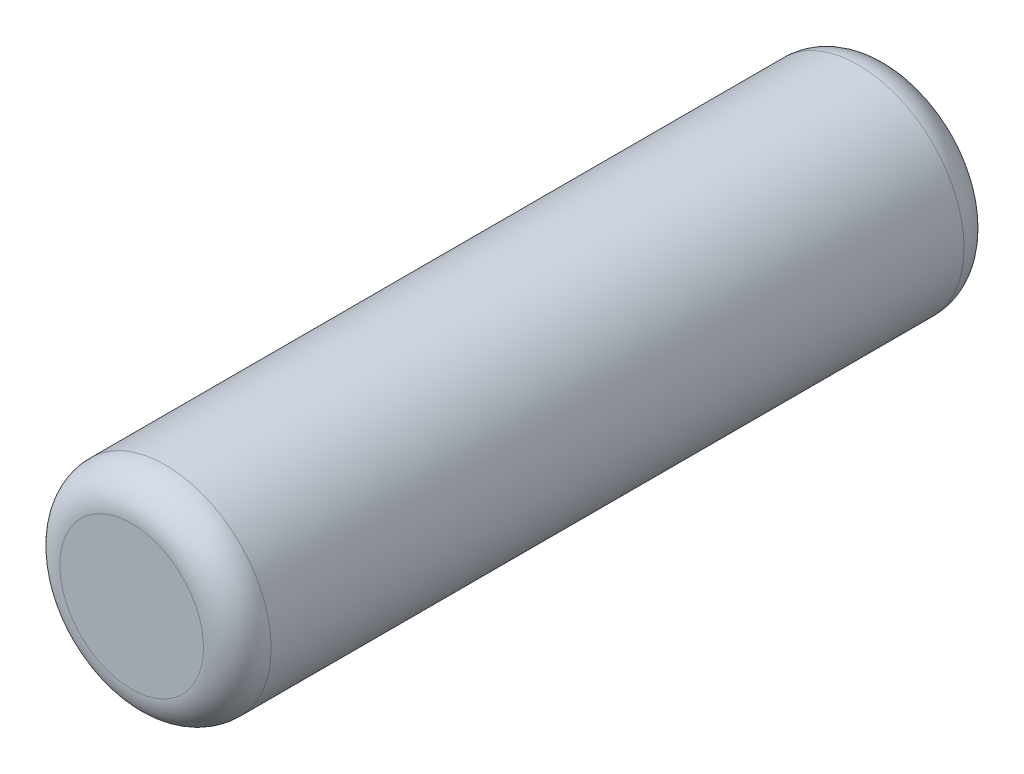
from build123d import *


with BuildPart() as part:
    # Esquisse1 → Base-R_volution (revolve)
    with BuildSketch(Plane(origin=(0, 0, 0), x_dir=(1, 0, 0), z_dir=(0, 1, 0))):
        with BuildLine():
            Line((0.85, 9), (0, 9))
            Line((0, 9), (0, 0))
            Line((0, 0), (0.85, 0))
            ThreePointArc((0.85, 0), (1.132842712, 0.117157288), (1.25, 0.4))
            Line((1.25, 0.4), (1.25, 8.6))
            ThreePointArc((1.25, 8.6), (1.132842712, 8.882842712), (0.85, 9))
        make_face()
    revolve(axis=Axis((0, 0, -9.00125), (0, 0, 1)))


solid = part.part
